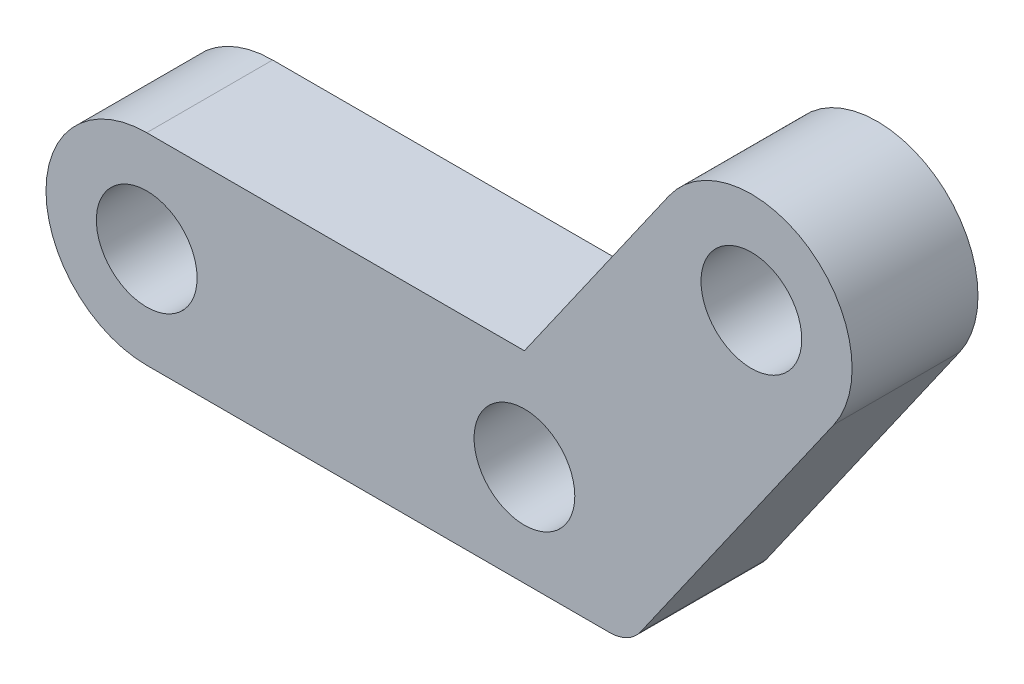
ISO-10303-21;
HEADER;
FILE_DESCRIPTION(('STEP AP214'),'2;1');
FILE_NAME('part.step','',(''),(''),'','','');
FILE_SCHEMA(('AUTOMOTIVE_DESIGN { 1 0 10303 214 1 1 1 1 }'));
ENDSEC;
DATA;
#1=APPLICATION_CONTEXT('core data for automotive mechanical design processes');
#2=APPLICATION_PROTOCOL_DEFINITION('international standard','automotive_design',2000,#1);
#3=PRODUCT_CONTEXT('',#1,'mechanical');
#4=PRODUCT('Part','Part','',(#3));
#5=PRODUCT_RELATED_PRODUCT_CATEGORY('part','',(#4));
#6=PRODUCT_DEFINITION_FORMATION('','',#4);
#7=PRODUCT_DEFINITION_CONTEXT('part definition',#1,'design');
#8=PRODUCT_DEFINITION('design','',#6,#7);
#9=PRODUCT_DEFINITION_SHAPE('','',#8);
#10=(LENGTH_UNIT() NAMED_UNIT(*) SI_UNIT(.MILLI.,.METRE.));
#11=(NAMED_UNIT(*) PLANE_ANGLE_UNIT() SI_UNIT($,.RADIAN.));
#12=(NAMED_UNIT(*) SI_UNIT($,.STERADIAN.) SOLID_ANGLE_UNIT());
#13=UNCERTAINTY_MEASURE_WITH_UNIT(LENGTH_MEASURE(1.E-05),#10,'distance_accuracy_value','');
#14=(GEOMETRIC_REPRESENTATION_CONTEXT(3) GLOBAL_UNCERTAINTY_ASSIGNED_CONTEXT((#13)) GLOBAL_UNIT_ASSIGNED_CONTEXT((#10,
#11,#12)) REPRESENTATION_CONTEXT('',''));
#15=CARTESIAN_POINT('',(0.,0.,0.));
#16=DIRECTION('',(0.,0.,1.));
#17=DIRECTION('',(1.,0.,0.));
#18=AXIS2_PLACEMENT_3D('',#15,#16,#17);
#19=CARTESIAN_POINT('',(0.,20.32,25.4));
#20=DIRECTION('',(0.,0.,1.));
#21=DIRECTION('',(1.,0.,0.));
#22=AXIS2_PLACEMENT_3D('',#19,#20,#21);
#23=PLANE('',#22);
#24=CARTESIAN_POINT('',(121.982852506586,70.5978506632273,25.4));
#25=DIRECTION('',(0.,0.,1.));
#26=DIRECTION('',(1.,0.,0.));
#27=AXIS2_PLACEMENT_3D('',#24,#25,#26);
#28=CIRCLE('',#27,10.1600000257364);
#29=CARTESIAN_POINT('',(132.142852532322,70.5978506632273,25.4));
#30=VERTEX_POINT('',#29);
#31=EDGE_CURVE('E527',#30,#30,#28,.T.);
#32=ORIENTED_EDGE('',*,*,#31,.F.);
#33=EDGE_LOOP('',(#32));
#34=FACE_BOUND('',#33,.T.);
#35=CARTESIAN_POINT('',(0.,20.32,25.4));
#36=DIRECTION('',(0.,0.,1.));
#37=DIRECTION('',(1.,0.,0.));
#38=AXIS2_PLACEMENT_3D('',#35,#36,#37);
#39=CIRCLE('',#38,20.32);
#40=CARTESIAN_POINT('',(0.,40.64,25.4));
#41=VERTEX_POINT('',#40);
#42=CARTESIAN_POINT('',(0.,0.,25.4));
#43=VERTEX_POINT('',#42);
#44=EDGE_CURVE('E442',#41,#43,#39,.T.);
#45=ORIENTED_EDGE('',*,*,#44,.T.);
#46=DIRECTION('',(1.,0.,0.));
#47=VECTOR('',#46,1.);
#48=CARTESIAN_POINT('',(0.,0.,25.4));
#49=LINE('',#48,#47);
#50=CARTESIAN_POINT('',(93.3891240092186,0.,25.4));
#51=VERTEX_POINT('',#50);
#52=EDGE_CURVE('E421',#43,#51,#49,.T.);
#53=ORIENTED_EDGE('',*,*,#52,.T.);
#54=CARTESIAN_POINT('',(93.3891240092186,7.62,25.4));
#55=DIRECTION('',(0.,0.,1.));
#56=DIRECTION('',(-1.,0.,0.));
#57=AXIS2_PLACEMENT_3D('',#54,#55,#56);
#58=CIRCLE('',#57,7.61999999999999);
#59=CARTESIAN_POINT('',(99.6310625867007,3.24934755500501,25.4));
#60=VERTEX_POINT('',#59);
#61=EDGE_CURVE('E445',#51,#60,#58,.T.);
#62=ORIENTED_EDGE('',*,*,#61,.T.);
#63=DIRECTION('',(0.57357643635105,0.819152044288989,0.));
#64=VECTOR('',#63,1.);
#65=CARTESIAN_POINT('',(109.490339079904,17.3298536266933,25.4));
#66=LINE('',#65,#64);
#67=CARTESIAN_POINT('',(138.628022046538,58.942777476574,25.4));
#68=VERTEX_POINT('',#67);
#69=EDGE_CURVE('E447',#60,#68,#66,.T.);
#70=ORIENTED_EDGE('',*,*,#69,.T.);
#71=CARTESIAN_POINT('',(121.982852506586,70.5978506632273,25.4));
#72=DIRECTION('',(0.,0.,1.));
#73=DIRECTION('',(-1.,0.,0.));
#74=AXIS2_PLACEMENT_3D('',#71,#72,#73);
#75=CIRCLE('',#74,20.32);
#76=CARTESIAN_POINT('',(105.337682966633,82.2529238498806,25.4));
#77=VERTEX_POINT('',#76);
#78=EDGE_CURVE('E449',#68,#77,#75,.T.);
#79=ORIENTED_EDGE('',*,*,#78,.T.);
#80=DIRECTION('',(-0.573576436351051,-0.819152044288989,0.));
#81=VECTOR('',#80,1.);
#82=CARTESIAN_POINT('',(105.337682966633,82.2529238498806,25.4));
#83=LINE('',#82,#81);
#84=CARTESIAN_POINT('',(76.2,40.64,25.4));
#85=VERTEX_POINT('',#84);
#86=EDGE_CURVE('E368',#77,#85,#83,.T.);
#87=ORIENTED_EDGE('',*,*,#86,.T.);
#88=DIRECTION('',(-1.,0.,0.));
#89=VECTOR('',#88,1.);
#90=CARTESIAN_POINT('',(0.,40.64,25.4));
#91=LINE('',#90,#89);
#92=EDGE_CURVE('E363',#85,#41,#91,.T.);
#93=ORIENTED_EDGE('',*,*,#92,.T.);
#94=EDGE_LOOP('',(#45,#53,#62,#70,#79,#87,#93));
#95=FACE_BOUND('',#94,.T.);
#96=CARTESIAN_POINT('',(0.,20.32,25.4));
#97=DIRECTION('',(0.,0.,1.));
#98=DIRECTION('',(1.,0.,0.));
#99=AXIS2_PLACEMENT_3D('',#96,#97,#98);
#100=CIRCLE('',#99,10.16);
#101=CARTESIAN_POINT('',(10.16,20.32,25.4));
#102=VERTEX_POINT('',#101);
#103=EDGE_CURVE('E426',#102,#102,#100,.T.);
#104=ORIENTED_EDGE('',*,*,#103,.F.);
#105=EDGE_LOOP('',(#104));
#106=FACE_BOUND('',#105,.T.);
#107=CARTESIAN_POINT('',(76.2,20.32,25.4));
#108=DIRECTION('',(0.,0.,1.));
#109=DIRECTION('',(1.,0.,0.));
#110=AXIS2_PLACEMENT_3D('',#107,#108,#109);
#111=CIRCLE('',#110,10.16);
#112=CARTESIAN_POINT('',(86.36,20.32,25.4));
#113=VERTEX_POINT('',#112);
#114=EDGE_CURVE('E516',#113,#113,#111,.T.);
#115=ORIENTED_EDGE('',*,*,#114,.F.);
#116=EDGE_LOOP('',(#115));
#117=FACE_BOUND('',#116,.T.);
#118=ADVANCED_FACE('F348',(#34,#95,#106,#117),#23,.T.);
#119=CARTESIAN_POINT('',(0.,20.32,0.));
#120=DIRECTION('',(0.,0.,1.));
#121=DIRECTION('',(1.,0.,0.));
#122=AXIS2_PLACEMENT_3D('',#119,#120,#121);
#123=PLANE('',#122);
#124=CARTESIAN_POINT('',(121.982852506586,70.5978506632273,0.));
#125=DIRECTION('',(0.,0.,1.));
#126=DIRECTION('',(1.,0.,0.));
#127=AXIS2_PLACEMENT_3D('',#124,#125,#126);
#128=CIRCLE('',#127,10.1600000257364);
#129=CARTESIAN_POINT('',(132.142852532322,70.5978506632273,0.));
#130=VERTEX_POINT('',#129);
#131=EDGE_CURVE('E522',#130,#130,#128,.T.);
#132=ORIENTED_EDGE('',*,*,#131,.T.);
#133=EDGE_LOOP('',(#132));
#134=FACE_BOUND('',#133,.T.);
#135=CARTESIAN_POINT('',(0.,20.32,0.));
#136=DIRECTION('',(0.,0.,1.));
#137=DIRECTION('',(1.,0.,0.));
#138=AXIS2_PLACEMENT_3D('',#135,#136,#137);
#139=CIRCLE('',#138,20.32);
#140=CARTESIAN_POINT('',(0.,40.64,0.));
#141=VERTEX_POINT('',#140);
#142=CARTESIAN_POINT('',(0.,0.,0.));
#143=VERTEX_POINT('',#142);
#144=EDGE_CURVE('E412',#141,#143,#139,.T.);
#145=ORIENTED_EDGE('',*,*,#144,.F.);
#146=DIRECTION('',(-1.,0.,0.));
#147=VECTOR('',#146,1.);
#148=CARTESIAN_POINT('',(0.,40.64,0.));
#149=LINE('',#148,#147);
#150=CARTESIAN_POINT('',(76.2,40.64,0.));
#151=VERTEX_POINT('',#150);
#152=EDGE_CURVE('E440',#151,#141,#149,.T.);
#153=ORIENTED_EDGE('',*,*,#152,.F.);
#154=DIRECTION('',(-0.573576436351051,-0.819152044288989,0.));
#155=VECTOR('',#154,1.);
#156=CARTESIAN_POINT('',(105.337682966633,82.2529238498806,0.));
#157=LINE('',#156,#155);
#158=CARTESIAN_POINT('',(105.337682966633,82.2529238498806,0.));
#159=VERTEX_POINT('',#158);
#160=EDGE_CURVE('E438',#159,#151,#157,.T.);
#161=ORIENTED_EDGE('',*,*,#160,.F.);
#162=CARTESIAN_POINT('',(121.982852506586,70.5978506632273,0.));
#163=DIRECTION('',(0.,0.,1.));
#164=DIRECTION('',(-1.,0.,0.));
#165=AXIS2_PLACEMENT_3D('',#162,#163,#164);
#166=CIRCLE('',#165,20.32);
#167=CARTESIAN_POINT('',(138.628022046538,58.942777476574,0.));
#168=VERTEX_POINT('',#167);
#169=EDGE_CURVE('E436',#168,#159,#166,.T.);
#170=ORIENTED_EDGE('',*,*,#169,.F.);
#171=DIRECTION('',(0.573576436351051,0.819152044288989,0.));
#172=VECTOR('',#171,1.);
#173=CARTESIAN_POINT('',(109.490339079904,17.3298536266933,0.));
#174=LINE('',#173,#172);
#175=CARTESIAN_POINT('',(99.6310625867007,3.24934755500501,0.));
#176=VERTEX_POINT('',#175);
#177=EDGE_CURVE('E434',#176,#168,#174,.T.);
#178=ORIENTED_EDGE('',*,*,#177,.F.);
#179=CARTESIAN_POINT('',(93.3891240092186,7.62,0.));
#180=DIRECTION('',(0.,0.,1.));
#181=DIRECTION('',(-1.,0.,0.));
#182=AXIS2_PLACEMENT_3D('',#179,#180,#181);
#183=CIRCLE('',#182,7.61999999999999);
#184=CARTESIAN_POINT('',(93.3891240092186,0.,0.));
#185=VERTEX_POINT('',#184);
#186=EDGE_CURVE('E414',#185,#176,#183,.T.);
#187=ORIENTED_EDGE('',*,*,#186,.F.);
#188=DIRECTION('',(1.,0.,0.));
#189=VECTOR('',#188,1.);
#190=CARTESIAN_POINT('',(76.2,0.,0.));
#191=LINE('',#190,#189);
#192=EDGE_CURVE('E407',#143,#185,#191,.T.);
#193=ORIENTED_EDGE('',*,*,#192,.F.);
#194=EDGE_LOOP('',(#145,#153,#161,#170,#178,#187,#193));
#195=FACE_BOUND('',#194,.T.);
#196=CARTESIAN_POINT('',(0.,20.32,0.));
#197=DIRECTION('',(0.,0.,1.));
#198=DIRECTION('',(1.,0.,0.));
#199=AXIS2_PLACEMENT_3D('',#196,#197,#198);
#200=CIRCLE('',#199,10.16);
#201=CARTESIAN_POINT('',(10.16,20.32,0.));
#202=VERTEX_POINT('',#201);
#203=EDGE_CURVE('E429',#202,#202,#200,.T.);
#204=ORIENTED_EDGE('',*,*,#203,.T.);
#205=EDGE_LOOP('',(#204));
#206=FACE_BOUND('',#205,.T.);
#207=CARTESIAN_POINT('',(76.2,20.32,0.));
#208=DIRECTION('',(0.,0.,1.));
#209=DIRECTION('',(1.,0.,0.));
#210=AXIS2_PLACEMENT_3D('',#207,#208,#209);
#211=CIRCLE('',#210,10.16);
#212=CARTESIAN_POINT('',(86.36,20.32,0.));
#213=VERTEX_POINT('',#212);
#214=EDGE_CURVE('E519',#213,#213,#211,.T.);
#215=ORIENTED_EDGE('',*,*,#214,.T.);
#216=EDGE_LOOP('',(#215));
#217=FACE_BOUND('',#216,.T.);
#218=ADVANCED_FACE('F408',(#134,#195,#206,#217),#123,.F.);
#219=CARTESIAN_POINT('',(0.,20.32,25.4));
#220=DIRECTION('',(0.,0.,-1.));
#221=DIRECTION('',(-1.,0.,0.));
#222=AXIS2_PLACEMENT_3D('',#219,#220,#221);
#223=CYLINDRICAL_SURFACE('',#222,20.32);
#224=ORIENTED_EDGE('',*,*,#144,.T.);
#225=DIRECTION('',(0.,0.,-1.));
#226=VECTOR('',#225,1.);
#227=CARTESIAN_POINT('',(0.,0.,25.4));
#228=LINE('',#227,#226);
#229=EDGE_CURVE('E11',#43,#143,#228,.T.);
#230=ORIENTED_EDGE('',*,*,#229,.F.);
#231=ORIENTED_EDGE('',*,*,#44,.F.);
#232=DIRECTION('',(0.,0.,-1.));
#233=VECTOR('',#232,1.);
#234=CARTESIAN_POINT('',(0.,40.64,25.4));
#235=LINE('',#234,#233);
#236=EDGE_CURVE('E425',#41,#141,#235,.T.);
#237=ORIENTED_EDGE('',*,*,#236,.T.);
#238=EDGE_LOOP('',(#224,#230,#231,#237));
#239=FACE_BOUND('',#238,.T.);
#240=ADVANCED_FACE('F350',(#239),#223,.T.);
#241=CARTESIAN_POINT('',(76.2,0.,25.4));
#242=DIRECTION('',(0.,1.,0.));
#243=DIRECTION('',(0.,0.,1.));
#244=AXIS2_PLACEMENT_3D('',#241,#242,#243);
#245=PLANE('',#244);
#246=ORIENTED_EDGE('',*,*,#192,.T.);
#247=DIRECTION('',(0.,0.,-1.));
#248=VECTOR('',#247,1.);
#249=CARTESIAN_POINT('',(93.3891240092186,0.,25.4));
#250=LINE('',#249,#248);
#251=EDGE_CURVE('E356',#51,#185,#250,.T.);
#252=ORIENTED_EDGE('',*,*,#251,.F.);
#253=ORIENTED_EDGE('',*,*,#52,.F.);
#254=ORIENTED_EDGE('',*,*,#229,.T.);
#255=EDGE_LOOP('',(#246,#252,#253,#254));
#256=FACE_BOUND('',#255,.T.);
#257=ADVANCED_FACE('F420',(#256),#245,.F.);
#258=CARTESIAN_POINT('',(93.3891240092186,7.62,25.4));
#259=DIRECTION('',(0.,0.,-1.));
#260=DIRECTION('',(-1.,0.,0.));
#261=AXIS2_PLACEMENT_3D('',#258,#259,#260);
#262=CYLINDRICAL_SURFACE('',#261,7.61999999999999);
#263=ORIENTED_EDGE('',*,*,#186,.T.);
#264=DIRECTION('',(0.,0.,-1.));
#265=VECTOR('',#264,1.);
#266=CARTESIAN_POINT('',(99.6310625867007,3.24934755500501,25.4));
#267=LINE('',#266,#265);
#268=EDGE_CURVE('E463',#60,#176,#267,.T.);
#269=ORIENTED_EDGE('',*,*,#268,.F.);
#270=ORIENTED_EDGE('',*,*,#61,.F.);
#271=ORIENTED_EDGE('',*,*,#251,.T.);
#272=EDGE_LOOP('',(#263,#269,#270,#271));
#273=FACE_BOUND('',#272,.T.);
#274=ADVANCED_FACE('F467',(#273),#262,.T.);
#275=CARTESIAN_POINT('',(109.490339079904,17.3298536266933,25.4));
#276=DIRECTION('',(-0.819152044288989,0.573576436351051,0.));
#277=DIRECTION('',(-0.573576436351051,-0.819152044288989,0.));
#278=AXIS2_PLACEMENT_3D('',#275,#276,#277);
#279=PLANE('',#278);
#280=ORIENTED_EDGE('',*,*,#177,.T.);
#281=DIRECTION('',(0.,0.,-1.));
#282=VECTOR('',#281,1.);
#283=CARTESIAN_POINT('',(138.628022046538,58.942777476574,25.4));
#284=LINE('',#283,#282);
#285=EDGE_CURVE('E460',#68,#168,#284,.T.);
#286=ORIENTED_EDGE('',*,*,#285,.F.);
#287=ORIENTED_EDGE('',*,*,#69,.F.);
#288=ORIENTED_EDGE('',*,*,#268,.T.);
#289=EDGE_LOOP('',(#280,#286,#287,#288));
#290=FACE_BOUND('',#289,.T.);
#291=ADVANCED_FACE('F475',(#290),#279,.F.);
#292=CARTESIAN_POINT('',(121.982852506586,70.5978506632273,25.4));
#293=DIRECTION('',(0.,0.,-1.));
#294=DIRECTION('',(-1.,0.,0.));
#295=AXIS2_PLACEMENT_3D('',#292,#293,#294);
#296=CYLINDRICAL_SURFACE('',#295,20.32);
#297=ORIENTED_EDGE('',*,*,#169,.T.);
#298=DIRECTION('',(0.,0.,-1.));
#299=VECTOR('',#298,1.);
#300=CARTESIAN_POINT('',(105.337682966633,82.2529238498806,25.4));
#301=LINE('',#300,#299);
#302=EDGE_CURVE('E457',#77,#159,#301,.T.);
#303=ORIENTED_EDGE('',*,*,#302,.F.);
#304=ORIENTED_EDGE('',*,*,#78,.F.);
#305=ORIENTED_EDGE('',*,*,#285,.T.);
#306=EDGE_LOOP('',(#297,#303,#304,#305));
#307=FACE_BOUND('',#306,.T.);
#308=ADVANCED_FACE('F478',(#307),#296,.T.);
#309=CARTESIAN_POINT('',(105.337682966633,82.2529238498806,25.4));
#310=DIRECTION('',(0.819152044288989,-0.573576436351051,0.));
#311=DIRECTION('',(0.573576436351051,0.819152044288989,0.));
#312=AXIS2_PLACEMENT_3D('',#309,#310,#311);
#313=PLANE('',#312);
#314=ORIENTED_EDGE('',*,*,#160,.T.);
#315=DIRECTION('',(0.,0.,-1.));
#316=VECTOR('',#315,1.);
#317=CARTESIAN_POINT('',(76.2,40.64,25.4));
#318=LINE('',#317,#316);
#319=EDGE_CURVE('E454',#85,#151,#318,.T.);
#320=ORIENTED_EDGE('',*,*,#319,.F.);
#321=ORIENTED_EDGE('',*,*,#86,.F.);
#322=ORIENTED_EDGE('',*,*,#302,.T.);
#323=EDGE_LOOP('',(#314,#320,#321,#322));
#324=FACE_BOUND('',#323,.T.);
#325=ADVANCED_FACE('F481',(#324),#313,.F.);
#326=CARTESIAN_POINT('',(0.,40.64,25.4));
#327=DIRECTION('',(0.,-1.,0.));
#328=DIRECTION('',(1.,0.,0.));
#329=AXIS2_PLACEMENT_3D('',#326,#327,#328);
#330=PLANE('',#329);
#331=ORIENTED_EDGE('',*,*,#152,.T.);
#332=ORIENTED_EDGE('',*,*,#236,.F.);
#333=ORIENTED_EDGE('',*,*,#92,.F.);
#334=ORIENTED_EDGE('',*,*,#319,.T.);
#335=EDGE_LOOP('',(#331,#332,#333,#334));
#336=FACE_BOUND('',#335,.T.);
#337=ADVANCED_FACE('F483',(#336),#330,.F.);
#338=CARTESIAN_POINT('',(0.,20.32,25.4));
#339=DIRECTION('',(0.,0.,-1.));
#340=DIRECTION('',(-1.,0.,0.));
#341=AXIS2_PLACEMENT_3D('',#338,#339,#340);
#342=CYLINDRICAL_SURFACE('',#341,10.16);
#343=ORIENTED_EDGE('',*,*,#103,.T.);
#344=EDGE_LOOP('',(#343));
#345=FACE_BOUND('',#344,.T.);
#346=ORIENTED_EDGE('',*,*,#203,.F.);
#347=EDGE_LOOP('',(#346));
#348=FACE_BOUND('',#347,.T.);
#349=ADVANCED_FACE('F485',(#345,#348),#342,.F.);
#350=CARTESIAN_POINT('',(121.982852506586,70.5978506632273,25.4));
#351=DIRECTION('',(0.,0.,-1.));
#352=DIRECTION('',(-1.,0.,0.));
#353=AXIS2_PLACEMENT_3D('',#350,#351,#352);
#354=CYLINDRICAL_SURFACE('',#353,10.1600000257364);
#355=ORIENTED_EDGE('',*,*,#31,.T.);
#356=EDGE_LOOP('',(#355));
#357=FACE_BOUND('',#356,.T.);
#358=ORIENTED_EDGE('',*,*,#131,.F.);
#359=EDGE_LOOP('',(#358));
#360=FACE_BOUND('',#359,.T.);
#361=ADVANCED_FACE('F491',(#357,#360),#354,.F.);
#362=CARTESIAN_POINT('',(76.2,20.32,25.4));
#363=DIRECTION('',(0.,0.,-1.));
#364=DIRECTION('',(-1.,0.,0.));
#365=AXIS2_PLACEMENT_3D('',#362,#363,#364);
#366=CYLINDRICAL_SURFACE('',#365,10.16);
#367=ORIENTED_EDGE('',*,*,#114,.T.);
#368=EDGE_LOOP('',(#367));
#369=FACE_BOUND('',#368,.T.);
#370=ORIENTED_EDGE('',*,*,#214,.F.);
#371=EDGE_LOOP('',(#370));
#372=FACE_BOUND('',#371,.T.);
#373=ADVANCED_FACE('F507',(#369,#372),#366,.F.);
#374=CLOSED_SHELL('',(#118,#218,#240,#257,#274,#291,#308,#325,#337,#349,#361,#373));
#375=MANIFOLD_SOLID_BREP('B2',#374);
#376=ADVANCED_BREP_SHAPE_REPRESENTATION('',(#18,#375),#14);
#377=SHAPE_DEFINITION_REPRESENTATION(#9,#376);
ENDSEC;
END-ISO-10303-21;
